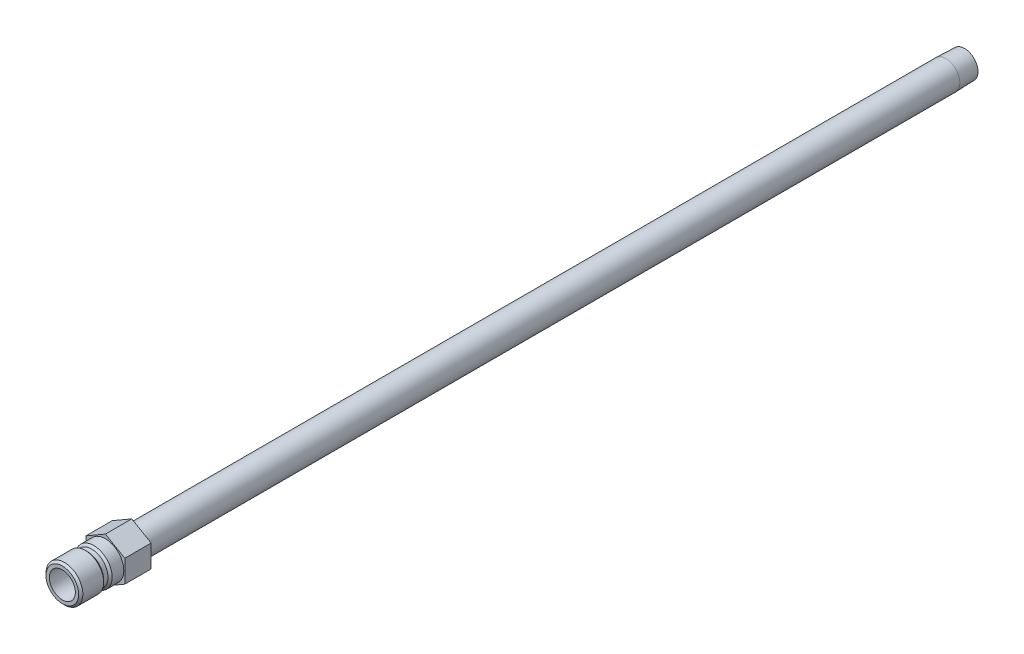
from build123d import *

# Parameters (mm, degrees)
SKETCH2_R           = 4.7625
BOSS_EXTRUDE1_DEPTH = 9.652


with BuildPart() as part:
    # Sketch1 → Revolve1 (revolve)
    with BuildSketch(Plane(origin=(0, 0, 0), x_dir=(0, 0, -1), z_dir=(1, 0, 0))):
        Polygon((-15.748, 4.7625), (-15.748, 5.9817), (-14.986, 6.7437), (-7.366, 6.7437), (-6.604, 5.9817), (-5.0165, 5.9817), (-4.2545, 6.7437), (9.652, 6.7437), (9.652, 5.1435), (307.594, 5.1435), (314.452, 4.929188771), (314.452, 3.4163), (-2.840212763, 3.4163), (-3.556, 4.7625), align=None)
    revolve(axis=Axis((0, 0, -9.652), (0, 0, 1)))

    # Sketch2 → Boss-Extrude1 (add)
    with BuildSketch(Plane.XY):
        Polygon((-7.112, 4.106115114), (-7.112, -4.106115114), (0, -8.212230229), (7.112, -4.106115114), (7.112, 4.106115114), (0, 8.212230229), align=None)
        with Locations(Location((0, 0, 0), (0, 0, 90))):
            Circle(SKETCH2_R, mode=Mode.SUBTRACT)
    extrude(amount=-BOSS_EXTRUDE1_DEPTH)


solid = part.part
